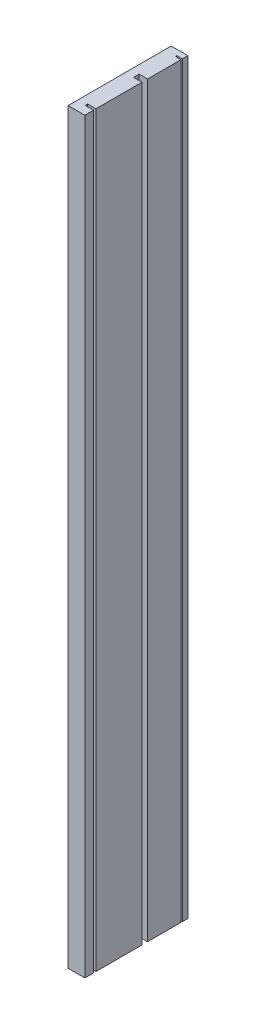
from build123d import *

# Parameters (mm, degrees)
SKETCH2_W           = 234.95
SKETCH2_H           = 1219.2
BOSS_EXTRUDE1_DEPTH = 19.05
SKETCH3_W           = 19.05
SKETCH3_H           = 5.588
SKETCH3_H_2         = 12.7
SKETCH3_W_2         = 12.7
SKETCH3_H_3         = 3.175
CUT_EXTRUDE1_DEPTH  = 1242.778178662
BOSS_EXTRUDE2_DEPTH = 482.6


with BuildPart() as part:
    # Sketch2 → Boss-Extrude1 (new, symmetric)
    with BuildSketch(Plane(origin=(0, 0, 0), x_dir=(0, 0, -1), z_dir=(1, 0, 0))):
        with Locations((117.475, 609.6)):
            Rectangle(SKETCH2_W, SKETCH2_H)
    extrude(amount=BOSS_EXTRUDE1_DEPTH, both=True)

    # Sketch3 → Cut-Extrude1 (cut, through all)
    with BuildSketch(Plane(origin=(0, 1219.2, 0), x_dir=(1, 0, 0), z_dir=(0, 1, 0))):
        with Locations((9.525, 22.606)):
            Rectangle(SKETCH3_W, SKETCH3_H)
        with Locations((9.525, 136.525)):
            Rectangle(SKETCH3_W, SKETCH3_H_2)
        with Locations((12.7, 220.6625)):
            Rectangle(SKETCH3_W_2, SKETCH3_H_3)
    extrude(amount=-CUT_EXTRUDE1_DEPTH, mode=Mode.SUBTRACT)

    # Sketch4 → Boss-Extrude2 (add)
    with BuildSketch(Plane.XZ):
        Polygon((0, -25.4), (0, -19.812), (19.05, -19.812), (19.05, 0), (-19.05, 0), (-19.05, -234.95), (19.05, -234.95), (19.05, -222.25), (6.35, -222.25), (6.35, -219.075), (19.05, -219.075), (19.05, -142.875), (0, -142.875), (0, -130.175), (19.05, -130.175), (19.05, -25.4), align=None)
    extrude(amount=BOSS_EXTRUDE2_DEPTH)


solid = part.part
